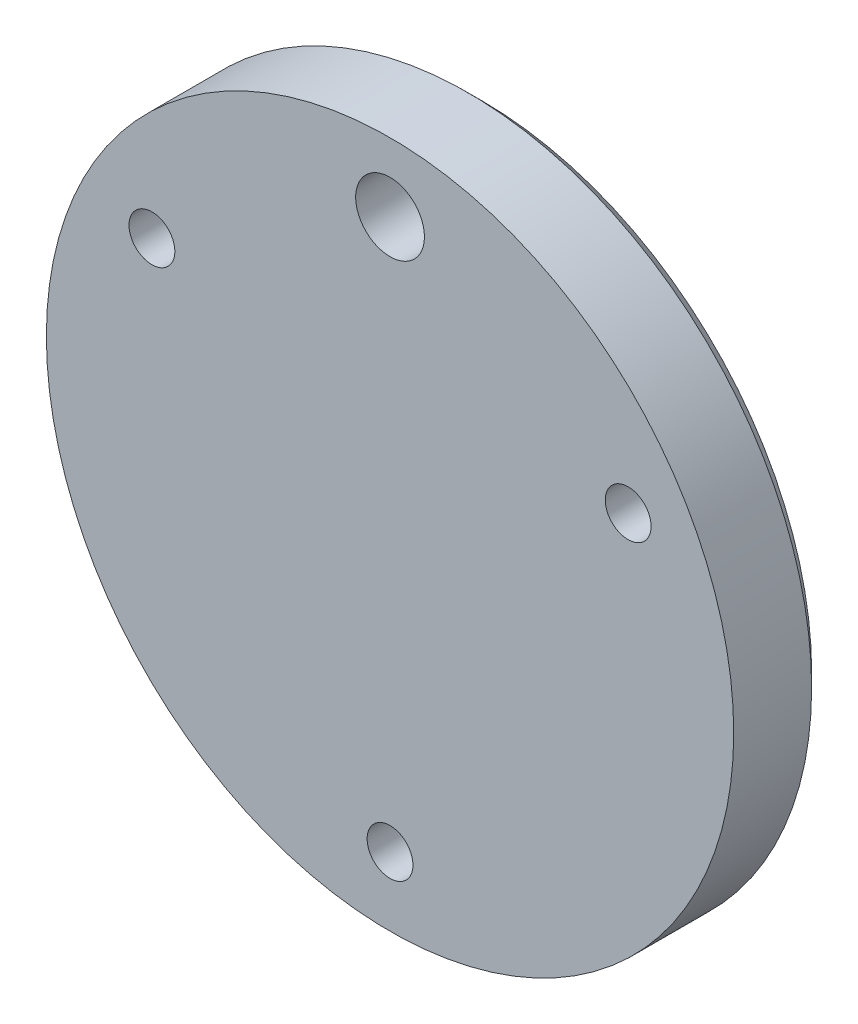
ISO-10303-21;
HEADER;
FILE_DESCRIPTION(('STEP AP214'),'2;1');
FILE_NAME('part.step','',(''),(''),'','','');
FILE_SCHEMA(('AUTOMOTIVE_DESIGN { 1 0 10303 214 1 1 1 1 }'));
ENDSEC;
DATA;
#1=APPLICATION_CONTEXT('core data for automotive mechanical design processes');
#2=APPLICATION_PROTOCOL_DEFINITION('international standard','automotive_design',2000,#1);
#3=PRODUCT_CONTEXT('',#1,'mechanical');
#4=PRODUCT('Part','Part','',(#3));
#5=PRODUCT_RELATED_PRODUCT_CATEGORY('part','',(#4));
#6=PRODUCT_DEFINITION_FORMATION('','',#4);
#7=PRODUCT_DEFINITION_CONTEXT('part definition',#1,'design');
#8=PRODUCT_DEFINITION('design','',#6,#7);
#9=PRODUCT_DEFINITION_SHAPE('','',#8);
#10=(LENGTH_UNIT() NAMED_UNIT(*) SI_UNIT(.MILLI.,.METRE.));
#11=(NAMED_UNIT(*) PLANE_ANGLE_UNIT() SI_UNIT($,.RADIAN.));
#12=(NAMED_UNIT(*) SI_UNIT($,.STERADIAN.) SOLID_ANGLE_UNIT());
#13=UNCERTAINTY_MEASURE_WITH_UNIT(LENGTH_MEASURE(1.E-05),#10,'distance_accuracy_value','');
#14=(GEOMETRIC_REPRESENTATION_CONTEXT(3) GLOBAL_UNCERTAINTY_ASSIGNED_CONTEXT((#13)) GLOBAL_UNIT_ASSIGNED_CONTEXT((#10,
#11,#12)) REPRESENTATION_CONTEXT('',''));
#15=CARTESIAN_POINT('',(0.,0.,0.));
#16=DIRECTION('',(0.,0.,1.));
#17=DIRECTION('',(1.,0.,0.));
#18=AXIS2_PLACEMENT_3D('',#15,#16,#17);
#19=CARTESIAN_POINT('',(0.,0.,2.));
#20=DIRECTION('',(0.,0.,-1.));
#21=DIRECTION('',(-1.,0.,0.));
#22=AXIS2_PLACEMENT_3D('',#19,#20,#21);
#23=CYLINDRICAL_SURFACE('',#22,7.5);
#24=CARTESIAN_POINT('',(0.,0.,0.300000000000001));
#25=DIRECTION('',(0.,0.,1.));
#26=DIRECTION('',(1.,0.,0.));
#27=AXIS2_PLACEMENT_3D('',#24,#25,#26);
#28=CIRCLE('',#27,7.5);
#29=CARTESIAN_POINT('',(7.5,0.,0.300000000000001));
#30=VERTEX_POINT('',#29);
#31=EDGE_CURVE('E64',#30,#30,#28,.T.);
#32=ORIENTED_EDGE('',*,*,#31,.T.);
#33=EDGE_LOOP('',(#32));
#34=FACE_BOUND('',#33,.T.);
#35=CARTESIAN_POINT('',(0.,0.,2.));
#36=DIRECTION('',(0.,0.,1.));
#37=DIRECTION('',(1.,0.,0.));
#38=AXIS2_PLACEMENT_3D('',#35,#36,#37);
#39=CIRCLE('',#38,7.5);
#40=CARTESIAN_POINT('',(7.5,0.,2.));
#41=VERTEX_POINT('',#40);
#42=EDGE_CURVE('E67',#41,#41,#39,.T.);
#43=ORIENTED_EDGE('',*,*,#42,.F.);
#44=EDGE_LOOP('',(#43));
#45=FACE_BOUND('',#44,.T.);
#46=ADVANCED_FACE('F30',(#34,#45),#23,.T.);
#47=CARTESIAN_POINT('',(0.,0.,2.));
#48=DIRECTION('',(0.,0.,1.));
#49=DIRECTION('',(1.,0.,0.));
#50=AXIS2_PLACEMENT_3D('',#47,#48,#49);
#51=PLANE('',#50);
#52=CARTESIAN_POINT('',(-5.19615242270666,2.99999999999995,2.));
#53=DIRECTION('',(0.,0.,-1.));
#54=DIRECTION('',(-1.,0.,0.));
#55=AXIS2_PLACEMENT_3D('',#52,#53,#54);
#56=CIRCLE('',#55,0.5);
#57=CARTESIAN_POINT('',(-5.69615242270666,2.99999999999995,2.));
#58=VERTEX_POINT('',#57);
#59=EDGE_CURVE('E79',#58,#58,#56,.T.);
#60=ORIENTED_EDGE('',*,*,#59,.T.);
#61=EDGE_LOOP('',(#60));
#62=FACE_BOUND('',#61,.T.);
#63=CARTESIAN_POINT('',(5.19615242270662,3.00000000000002,2.));
#64=DIRECTION('',(0.,0.,-1.));
#65=DIRECTION('',(-1.,0.,0.));
#66=AXIS2_PLACEMENT_3D('',#63,#64,#65);
#67=CIRCLE('',#66,0.500000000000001);
#68=CARTESIAN_POINT('',(4.69615242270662,3.00000000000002,2.));
#69=VERTEX_POINT('',#68);
#70=EDGE_CURVE('E76',#69,#69,#67,.T.);
#71=ORIENTED_EDGE('',*,*,#70,.T.);
#72=EDGE_LOOP('',(#71));
#73=FACE_BOUND('',#72,.T.);
#74=CARTESIAN_POINT('',(0.,-6.,2.));
#75=DIRECTION('',(0.,0.,-1.));
#76=DIRECTION('',(-1.,0.,0.));
#77=AXIS2_PLACEMENT_3D('',#74,#75,#76);
#78=CIRCLE('',#77,0.5);
#79=CARTESIAN_POINT('',(-0.500000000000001,-6.,2.));
#80=VERTEX_POINT('',#79);
#81=EDGE_CURVE('E73',#80,#80,#78,.T.);
#82=ORIENTED_EDGE('',*,*,#81,.T.);
#83=EDGE_LOOP('',(#82));
#84=FACE_BOUND('',#83,.T.);
#85=CARTESIAN_POINT('',(0.,6.,2.));
#86=DIRECTION('',(0.,0.,1.));
#87=DIRECTION('',(1.,0.,0.));
#88=AXIS2_PLACEMENT_3D('',#85,#86,#87);
#89=CIRCLE('',#88,0.75);
#90=CARTESIAN_POINT('',(0.75,6.,2.));
#91=VERTEX_POINT('',#90);
#92=EDGE_CURVE('E70',#91,#91,#89,.F.);
#93=ORIENTED_EDGE('',*,*,#92,.T.);
#94=EDGE_LOOP('',(#93));
#95=FACE_BOUND('',#94,.T.);
#96=ORIENTED_EDGE('',*,*,#42,.T.);
#97=EDGE_LOOP('',(#96));
#98=FACE_BOUND('',#97,.T.);
#99=ADVANCED_FACE('F83',(#62,#73,#84,#95,#98),#51,.T.);
#100=CARTESIAN_POINT('',(0.,0.,0.));
#101=DIRECTION('',(0.,0.,1.));
#102=DIRECTION('',(1.,0.,0.));
#103=AXIS2_PLACEMENT_3D('',#100,#101,#102);
#104=PLANE('',#103);
#105=CARTESIAN_POINT('',(0.,-6.,0.));
#106=DIRECTION('',(0.,0.,1.));
#107=DIRECTION('',(1.,0.,0.));
#108=AXIS2_PLACEMENT_3D('',#105,#106,#107);
#109=CIRCLE('',#108,0.600000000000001);
#110=CARTESIAN_POINT('',(0.6,-6.,0.));
#111=VERTEX_POINT('',#110);
#112=EDGE_CURVE('E44',#111,#111,#109,.T.);
#113=ORIENTED_EDGE('',*,*,#112,.T.);
#114=EDGE_LOOP('',(#113));
#115=FACE_BOUND('',#114,.T.);
#116=CARTESIAN_POINT('',(5.19615242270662,3.00000000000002,0.));
#117=DIRECTION('',(0.,0.,1.));
#118=DIRECTION('',(1.,0.,0.));
#119=AXIS2_PLACEMENT_3D('',#116,#117,#118);
#120=CIRCLE('',#119,0.600000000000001);
#121=CARTESIAN_POINT('',(5.79615242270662,3.00000000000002,0.));
#122=VERTEX_POINT('',#121);
#123=EDGE_CURVE('E49',#122,#122,#120,.T.);
#124=ORIENTED_EDGE('',*,*,#123,.T.);
#125=EDGE_LOOP('',(#124));
#126=FACE_BOUND('',#125,.T.);
#127=CARTESIAN_POINT('',(0.,6.,0.));
#128=DIRECTION('',(0.,0.,1.));
#129=DIRECTION('',(1.,0.,0.));
#130=AXIS2_PLACEMENT_3D('',#127,#128,#129);
#131=CIRCLE('',#130,0.850000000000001);
#132=CARTESIAN_POINT('',(0.850000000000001,6.,0.));
#133=VERTEX_POINT('',#132);
#134=EDGE_CURVE('E52',#133,#133,#131,.T.);
#135=ORIENTED_EDGE('',*,*,#134,.T.);
#136=EDGE_LOOP('',(#135));
#137=FACE_BOUND('',#136,.T.);
#138=CARTESIAN_POINT('',(-5.19615242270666,2.99999999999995,0.));
#139=DIRECTION('',(0.,0.,1.));
#140=DIRECTION('',(1.,0.,0.));
#141=AXIS2_PLACEMENT_3D('',#138,#139,#140);
#142=CIRCLE('',#141,0.600000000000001);
#143=CARTESIAN_POINT('',(-4.59615242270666,2.99999999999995,0.));
#144=VERTEX_POINT('',#143);
#145=EDGE_CURVE('E55',#144,#144,#142,.T.);
#146=ORIENTED_EDGE('',*,*,#145,.T.);
#147=EDGE_LOOP('',(#146));
#148=FACE_BOUND('',#147,.T.);
#149=CARTESIAN_POINT('',(0.,0.,0.));
#150=DIRECTION('',(0.,0.,1.));
#151=DIRECTION('',(1.,0.,0.));
#152=AXIS2_PLACEMENT_3D('',#149,#150,#151);
#153=CIRCLE('',#152,7.2);
#154=CARTESIAN_POINT('',(7.2,0.,0.));
#155=VERTEX_POINT('',#154);
#156=EDGE_CURVE('E61',#155,#155,#153,.F.);
#157=ORIENTED_EDGE('',*,*,#156,.T.);
#158=EDGE_LOOP('',(#157));
#159=FACE_BOUND('',#158,.T.);
#160=ADVANCED_FACE('F106',(#115,#126,#137,#148,#159),#104,.F.);
#161=CARTESIAN_POINT('',(0.,6.,2.001));
#162=DIRECTION('',(0.,0.,-1.));
#163=DIRECTION('',(-1.,0.,0.));
#164=AXIS2_PLACEMENT_3D('',#161,#162,#163);
#165=CYLINDRICAL_SURFACE('',#164,0.75);
#166=CARTESIAN_POINT('',(0.,6.,0.1));
#167=DIRECTION('',(0.,0.,1.));
#168=DIRECTION('',(1.,0.,0.));
#169=AXIS2_PLACEMENT_3D('',#166,#167,#168);
#170=CIRCLE('',#169,0.75);
#171=CARTESIAN_POINT('',(0.75,6.,0.1));
#172=VERTEX_POINT('',#171);
#173=EDGE_CURVE('E36',#172,#172,#170,.F.);
#174=ORIENTED_EDGE('',*,*,#173,.T.);
#175=EDGE_LOOP('',(#174));
#176=FACE_BOUND('',#175,.T.);
#177=ORIENTED_EDGE('',*,*,#92,.F.);
#178=EDGE_LOOP('',(#177));
#179=FACE_BOUND('',#178,.T.);
#180=ADVANCED_FACE('F115',(#176,#179),#165,.F.);
#181=CARTESIAN_POINT('',(0.,-6.,2.));
#182=DIRECTION('',(0.,0.,-1.));
#183=DIRECTION('',(-1.,0.,0.));
#184=AXIS2_PLACEMENT_3D('',#181,#182,#183);
#185=CYLINDRICAL_SURFACE('',#184,0.5);
#186=CARTESIAN_POINT('',(0.,-6.,0.0999999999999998));
#187=DIRECTION('',(0.,0.,1.));
#188=DIRECTION('',(1.,0.,0.));
#189=AXIS2_PLACEMENT_3D('',#186,#187,#188);
#190=CIRCLE('',#189,0.5);
#191=CARTESIAN_POINT('',(0.499999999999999,-6.,0.0999999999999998));
#192=VERTEX_POINT('',#191);
#193=EDGE_CURVE('E58',#192,#192,#190,.F.);
#194=ORIENTED_EDGE('',*,*,#193,.T.);
#195=EDGE_LOOP('',(#194));
#196=FACE_BOUND('',#195,.T.);
#197=ORIENTED_EDGE('',*,*,#81,.F.);
#198=EDGE_LOOP('',(#197));
#199=FACE_BOUND('',#198,.T.);
#200=ADVANCED_FACE('F98',(#196,#199),#185,.F.);
#201=CARTESIAN_POINT('',(5.19615242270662,3.00000000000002,2.));
#202=DIRECTION('',(0.,0.,-1.));
#203=DIRECTION('',(-1.,0.,0.));
#204=AXIS2_PLACEMENT_3D('',#201,#202,#203);
#205=CYLINDRICAL_SURFACE('',#204,0.500000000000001);
#206=CARTESIAN_POINT('',(5.19615242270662,3.00000000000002,0.1));
#207=DIRECTION('',(0.,0.,1.));
#208=DIRECTION('',(1.,0.,0.));
#209=AXIS2_PLACEMENT_3D('',#206,#207,#208);
#210=CIRCLE('',#209,0.500000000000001);
#211=CARTESIAN_POINT('',(5.69615242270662,3.00000000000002,0.1));
#212=VERTEX_POINT('',#211);
#213=EDGE_CURVE('E40',#212,#212,#210,.F.);
#214=ORIENTED_EDGE('',*,*,#213,.T.);
#215=EDGE_LOOP('',(#214));
#216=FACE_BOUND('',#215,.T.);
#217=ORIENTED_EDGE('',*,*,#70,.F.);
#218=EDGE_LOOP('',(#217));
#219=FACE_BOUND('',#218,.T.);
#220=ADVANCED_FACE('F89',(#216,#219),#205,.F.);
#221=CARTESIAN_POINT('',(-5.19615242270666,2.99999999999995,2.));
#222=DIRECTION('',(0.,0.,-1.));
#223=DIRECTION('',(-1.,0.,0.));
#224=AXIS2_PLACEMENT_3D('',#221,#222,#223);
#225=CYLINDRICAL_SURFACE('',#224,0.5);
#226=CARTESIAN_POINT('',(-5.19615242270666,2.99999999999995,0.1));
#227=DIRECTION('',(0.,0.,1.));
#228=DIRECTION('',(1.,0.,0.));
#229=AXIS2_PLACEMENT_3D('',#226,#227,#228);
#230=CIRCLE('',#229,0.5);
#231=CARTESIAN_POINT('',(-4.69615242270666,2.99999999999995,0.1));
#232=VERTEX_POINT('',#231);
#233=EDGE_CURVE('E10',#232,#232,#230,.F.);
#234=ORIENTED_EDGE('',*,*,#233,.T.);
#235=EDGE_LOOP('',(#234));
#236=FACE_BOUND('',#235,.T.);
#237=ORIENTED_EDGE('',*,*,#59,.F.);
#238=EDGE_LOOP('',(#237));
#239=FACE_BOUND('',#238,.T.);
#240=ADVANCED_FACE('F86',(#236,#239),#225,.F.);
#241=CARTESIAN_POINT('',(0.,0.,0.300000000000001));
#242=DIRECTION('',(0.,0.,1.));
#243=DIRECTION('',(1.,0.,0.));
#244=AXIS2_PLACEMENT_3D('',#241,#242,#243);
#245=CONICAL_SURFACE('',#244,7.5,0.78539816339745);
#246=CARTESIAN_POINT('',(7.2,0.,0.));
#247=CARTESIAN_POINT('',(7.203125,0.,0.00312499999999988));
#248=CARTESIAN_POINT('',(7.20625,0.,0.00624999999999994));
#249=CARTESIAN_POINT('',(7.2125,0.,0.0125));
#250=CARTESIAN_POINT('',(7.215625,0.,0.0156250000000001));
#251=CARTESIAN_POINT('',(7.221875,0.,0.0218750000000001));
#252=CARTESIAN_POINT('',(7.225,0.,0.025));
#253=CARTESIAN_POINT('',(7.23125,0.,0.03125));
#254=CARTESIAN_POINT('',(7.234375,0.,0.034375));
#255=CARTESIAN_POINT('',(7.240625,0.,0.0406250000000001));
#256=CARTESIAN_POINT('',(7.24375,0.,0.0437500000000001));
#257=CARTESIAN_POINT('',(7.25,0.,0.0500000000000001));
#258=CARTESIAN_POINT('',(7.253125,0.,0.0531250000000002));
#259=CARTESIAN_POINT('',(7.259375,0.,0.0593750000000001));
#260=CARTESIAN_POINT('',(7.2625,0.,0.0625000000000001));
#261=CARTESIAN_POINT('',(7.26875,0.,0.06875));
#262=CARTESIAN_POINT('',(7.271875,0.,0.0718750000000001));
#263=CARTESIAN_POINT('',(7.278125,0.,0.0781250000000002));
#264=CARTESIAN_POINT('',(7.28125,0.,0.0812500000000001));
#265=CARTESIAN_POINT('',(7.2875,0.,0.0875000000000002));
#266=CARTESIAN_POINT('',(7.290625,0.,0.0906250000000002));
#267=CARTESIAN_POINT('',(7.296875,0.,0.0968750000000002));
#268=CARTESIAN_POINT('',(7.3,0.,0.1));
#269=CARTESIAN_POINT('',(7.30625,0.,0.10625));
#270=CARTESIAN_POINT('',(7.309375,0.,0.109375));
#271=CARTESIAN_POINT('',(7.315625,0.,0.115625));
#272=CARTESIAN_POINT('',(7.31875,0.,0.11875));
#273=CARTESIAN_POINT('',(7.325,0.,0.125));
#274=CARTESIAN_POINT('',(7.328125,0.,0.128125));
#275=CARTESIAN_POINT('',(7.334375,0.,0.134375));
#276=CARTESIAN_POINT('',(7.3375,0.,0.1375));
#277=CARTESIAN_POINT('',(7.34375,0.,0.14375));
#278=CARTESIAN_POINT('',(7.346875,0.,0.146875));
#279=CARTESIAN_POINT('',(7.353125,0.,0.153125));
#280=CARTESIAN_POINT('',(7.35625,0.,0.15625));
#281=CARTESIAN_POINT('',(7.3625,0.,0.1625));
#282=CARTESIAN_POINT('',(7.365625,0.,0.165625));
#283=CARTESIAN_POINT('',(7.371875,0.,0.171875));
#284=CARTESIAN_POINT('',(7.375,0.,0.175));
#285=CARTESIAN_POINT('',(7.38125,0.,0.18125));
#286=CARTESIAN_POINT('',(7.384375,0.,0.184375));
#287=CARTESIAN_POINT('',(7.390625,0.,0.190625));
#288=CARTESIAN_POINT('',(7.39375,0.,0.19375));
#289=CARTESIAN_POINT('',(7.4,0.,0.2));
#290=CARTESIAN_POINT('',(7.403125,0.,0.203125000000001));
#291=CARTESIAN_POINT('',(7.409375,0.,0.209375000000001));
#292=CARTESIAN_POINT('',(7.4125,0.,0.2125));
#293=CARTESIAN_POINT('',(7.41875,0.,0.21875));
#294=CARTESIAN_POINT('',(7.421875,0.,0.221875));
#295=CARTESIAN_POINT('',(7.428125,0.,0.228125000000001));
#296=CARTESIAN_POINT('',(7.43125,0.,0.231250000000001));
#297=CARTESIAN_POINT('',(7.4375,0.,0.237500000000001));
#298=CARTESIAN_POINT('',(7.440625,0.,0.240625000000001));
#299=CARTESIAN_POINT('',(7.446875,0.,0.246875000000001));
#300=CARTESIAN_POINT('',(7.45,0.,0.250000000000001));
#301=CARTESIAN_POINT('',(7.45625,0.,0.256250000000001));
#302=CARTESIAN_POINT('',(7.459375,0.,0.259375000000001));
#303=CARTESIAN_POINT('',(7.465625,0.,0.265625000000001));
#304=CARTESIAN_POINT('',(7.46875,0.,0.268750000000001));
#305=CARTESIAN_POINT('',(7.475,0.,0.275000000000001));
#306=CARTESIAN_POINT('',(7.478125,0.,0.278125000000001));
#307=CARTESIAN_POINT('',(7.484375,0.,0.284375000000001));
#308=CARTESIAN_POINT('',(7.4875,0.,0.287500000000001));
#309=CARTESIAN_POINT('',(7.49375,0.,0.293750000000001));
#310=CARTESIAN_POINT('',(7.496875,0.,0.296875));
#311=CARTESIAN_POINT('',(7.5,0.,0.300000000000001));
#312=B_SPLINE_CURVE_WITH_KNOTS('',3,(#246,#247,#248,#249,#250,#251,#252,#253,#254,#255,#256,
#257,#258,#259,#260,#261,#262,#263,#264,#265,#266,#267,#268,#269,#270,#271,#272,#273,#274,#275,
#276,#277,#278,#279,#280,#281,#282,#283,#284,#285,#286,#287,#288,#289,#290,#291,#292,#293,#294,
#295,#296,#297,#298,#299,#300,#301,#302,#303,#304,#305,#306,#307,#308,#309,#310,#311),
.UNSPECIFIED.,.F.,.F.,(4,2,2,2,2,2,2,2,2,2,2,2,2,2,2,2,2,2,2,2,2,2,2,2,2,2,2,2,2,2,2,2,4),(0.,
0.0132582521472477,0.0265165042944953,0.0397747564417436,0.0530330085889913,0.066291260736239,
0.0795495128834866,0.0928077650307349,0.106066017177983,0.11932426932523,0.132582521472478,
0.145840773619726,0.159099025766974,0.172357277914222,0.185615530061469,0.198873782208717,
0.212132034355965,0.225390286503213,0.238648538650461,0.251906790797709,0.265165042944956,
0.278423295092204,0.291681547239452,0.3049397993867,0.318198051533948,0.331456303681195,
0.344714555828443,0.357972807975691,0.371231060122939,0.384489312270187,0.397747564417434,
0.411005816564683,0.42426406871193),.UNSPECIFIED.);
#313=EDGE_CURVE('BSEAM88',#155,#30,#312,.T.);
#314=ORIENTED_EDGE('',*,*,#156,.F.);
#315=ORIENTED_EDGE('',*,*,#31,.F.);
#316=ORIENTED_EDGE('',*,*,#313,.T.);
#317=ORIENTED_EDGE('',*,*,#313,.F.);
#318=EDGE_LOOP('',(#314,#316,#315,#317));
#319=FACE_BOUND('',#318,.T.);
#320=ADVANCED_FACE('F88',(#319),#245,.T.);
#321=CARTESIAN_POINT('',(0.,-6.,0.0999999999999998));
#322=DIRECTION('',(0.,0.,-1.));
#323=DIRECTION('',(-1.,0.,0.));
#324=AXIS2_PLACEMENT_3D('',#321,#322,#323);
#325=CONICAL_SURFACE('',#324,0.5,0.78539816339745);
#326=ORIENTED_EDGE('',*,*,#112,.F.);
#327=EDGE_LOOP('',(#326));
#328=FACE_BOUND('',#327,.T.);
#329=ORIENTED_EDGE('',*,*,#193,.F.);
#330=EDGE_LOOP('',(#329));
#331=FACE_BOUND('',#330,.T.);
#332=ADVANCED_FACE('F95',(#328,#331),#325,.F.);
#333=CARTESIAN_POINT('',(5.19615242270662,3.00000000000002,0.1));
#334=DIRECTION('',(0.,0.,-1.));
#335=DIRECTION('',(-1.,0.,0.));
#336=AXIS2_PLACEMENT_3D('',#333,#334,#335);
#337=CONICAL_SURFACE('',#336,0.500000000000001,0.785398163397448);
#338=ORIENTED_EDGE('',*,*,#123,.F.);
#339=EDGE_LOOP('',(#338));
#340=FACE_BOUND('',#339,.T.);
#341=ORIENTED_EDGE('',*,*,#213,.F.);
#342=EDGE_LOOP('',(#341));
#343=FACE_BOUND('',#342,.T.);
#344=ADVANCED_FACE('F134',(#340,#343),#337,.F.);
#345=CARTESIAN_POINT('',(0.,6.,0.1));
#346=DIRECTION('',(0.,0.,-1.));
#347=DIRECTION('',(-1.,0.,0.));
#348=AXIS2_PLACEMENT_3D('',#345,#346,#347);
#349=CONICAL_SURFACE('',#348,0.75,0.78539816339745);
#350=ORIENTED_EDGE('',*,*,#134,.F.);
#351=EDGE_LOOP('',(#350));
#352=FACE_BOUND('',#351,.T.);
#353=ORIENTED_EDGE('',*,*,#173,.F.);
#354=EDGE_LOOP('',(#353));
#355=FACE_BOUND('',#354,.T.);
#356=ADVANCED_FACE('F140',(#352,#355),#349,.F.);
#357=CARTESIAN_POINT('',(-5.19615242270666,2.99999999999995,0.1));
#358=DIRECTION('',(0.,0.,-1.));
#359=DIRECTION('',(-1.,0.,0.));
#360=AXIS2_PLACEMENT_3D('',#357,#358,#359);
#361=CONICAL_SURFACE('',#360,0.5,0.785398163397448);
#362=ORIENTED_EDGE('',*,*,#145,.F.);
#363=EDGE_LOOP('',(#362));
#364=FACE_BOUND('',#363,.T.);
#365=ORIENTED_EDGE('',*,*,#233,.F.);
#366=EDGE_LOOP('',(#365));
#367=FACE_BOUND('',#366,.T.);
#368=ADVANCED_FACE('F147',(#364,#367),#361,.F.);
#369=CLOSED_SHELL('',(#46,#99,#160,#180,#200,#220,#240,#320,#332,#344,#356,#368));
#370=MANIFOLD_SOLID_BREP('B2',#369);
#371=ADVANCED_BREP_SHAPE_REPRESENTATION('',(#18,#370),#14);
#372=SHAPE_DEFINITION_REPRESENTATION(#9,#371);
ENDSEC;
END-ISO-10303-21;
